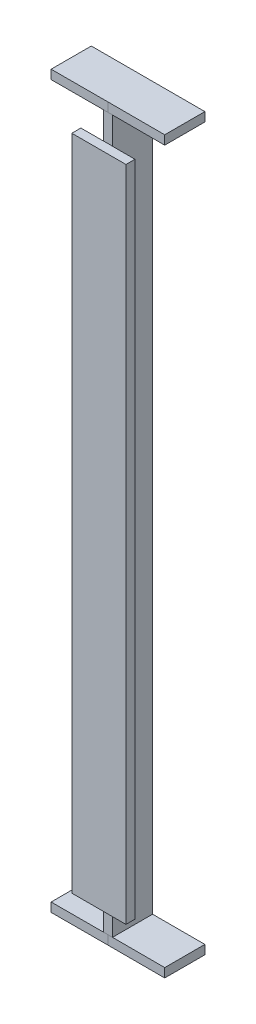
ISO-10303-21;
HEADER;
FILE_DESCRIPTION(('STEP AP214'),'2;1');
FILE_NAME('part.step','',(''),(''),'','','');
FILE_SCHEMA(('AUTOMOTIVE_DESIGN { 1 0 10303 214 1 1 1 1 }'));
ENDSEC;
DATA;
#1=APPLICATION_CONTEXT('core data for automotive mechanical design processes');
#2=APPLICATION_PROTOCOL_DEFINITION('international standard','automotive_design',2000,#1);
#3=PRODUCT_CONTEXT('',#1,'mechanical');
#4=PRODUCT('Part','Part','',(#3));
#5=PRODUCT_RELATED_PRODUCT_CATEGORY('part','',(#4));
#6=PRODUCT_DEFINITION_FORMATION('','',#4);
#7=PRODUCT_DEFINITION_CONTEXT('part definition',#1,'design');
#8=PRODUCT_DEFINITION('design','',#6,#7);
#9=PRODUCT_DEFINITION_SHAPE('','',#8);
#10=(LENGTH_UNIT() NAMED_UNIT(*) SI_UNIT(.MILLI.,.METRE.));
#11=(NAMED_UNIT(*) PLANE_ANGLE_UNIT() SI_UNIT($,.RADIAN.));
#12=(NAMED_UNIT(*) SI_UNIT($,.STERADIAN.) SOLID_ANGLE_UNIT());
#13=UNCERTAINTY_MEASURE_WITH_UNIT(LENGTH_MEASURE(1.E-05),#10,'distance_accuracy_value','');
#14=(GEOMETRIC_REPRESENTATION_CONTEXT(3) GLOBAL_UNCERTAINTY_ASSIGNED_CONTEXT((#13)) GLOBAL_UNIT_ASSIGNED_CONTEXT((#10,
#11,#12)) REPRESENTATION_CONTEXT('',''));
#15=CARTESIAN_POINT('',(0.,0.,0.));
#16=DIRECTION('',(0.,0.,1.));
#17=DIRECTION('',(1.,0.,0.));
#18=AXIS2_PLACEMENT_3D('',#15,#16,#17);
#19=CARTESIAN_POINT('',(0.,-19.999993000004,0.));
#20=DIRECTION('',(0.,-1.,0.));
#21=DIRECTION('',(0.,0.,-1.));
#22=AXIS2_PLACEMENT_3D('',#19,#20,#21);
#23=PLANE('',#22);
#24=DIRECTION('',(-1.,0.,0.));
#25=VECTOR('',#24,1.);
#26=CARTESIAN_POINT('',(1425.0409965,-19.999993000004,1746.042967));
#27=LINE('',#26,#25);
#28=CARTESIAN_POINT('',(1357.041001,-19.999993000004,1746.042967));
#29=VERTEX_POINT('',#28);
#30=CARTESIAN_POINT('',(1299.0409965,-19.999993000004,1746.042967));
#31=VERTEX_POINT('',#30);
#32=EDGE_CURVE('E125',#29,#31,#27,.T.);
#33=ORIENTED_EDGE('',*,*,#32,.F.);
#34=DIRECTION('',(0.,0.,1.));
#35=VECTOR('',#34,1.);
#36=CARTESIAN_POINT('',(1357.041001,-19.999993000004,0.));
#37=LINE('',#36,#35);
#38=CARTESIAN_POINT('',(1357.04100406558,-19.999993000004,1790.52054497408));
#39=VERTEX_POINT('',#38);
#40=EDGE_CURVE('E131',#29,#39,#37,.T.);
#41=ORIENTED_EDGE('',*,*,#40,.T.);
#42=DIRECTION('',(0.999999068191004,0.,-0.00136514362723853));
#43=VECTOR('',#42,1.);
#44=CARTESIAN_POINT('',(1299.0409965,-19.999993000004,1790.601969));
#45=LINE('',#44,#43);
#46=CARTESIAN_POINT('',(1299.0409965,-19.999993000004,1790.601969));
#47=VERTEX_POINT('',#46);
#48=EDGE_CURVE('E193',#47,#39,#45,.T.);
#49=ORIENTED_EDGE('',*,*,#48,.F.);
#50=DIRECTION('',(0.,0.,1.));
#51=VECTOR('',#50,1.);
#52=CARTESIAN_POINT('',(1299.0409965,-19.999993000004,1746.042967));
#53=LINE('',#52,#51);
#54=EDGE_CURVE('E119',#31,#47,#53,.T.);
#55=ORIENTED_EDGE('',*,*,#54,.F.);
#56=EDGE_LOOP('',(#33,#41,#49,#55));
#57=FACE_BOUND('',#56,.T.);
#58=ADVANCED_FACE('F39',(#57),#23,.T.);
#59=DIRECTION('',(0.999999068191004,0.,0.00136514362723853));
#60=VECTOR('',#59,1.);
#61=CARTESIAN_POINT('',(1425.0409965,-19.999993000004,1790.601969));
#62=LINE('',#61,#60);
#63=CARTESIAN_POINT('',(1367.04097653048,-19.999993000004,1790.51846885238));
#64=VERTEX_POINT('',#63);
#65=CARTESIAN_POINT('',(1425.0409965,-19.999993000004,1790.601969));
#66=VERTEX_POINT('',#65);
#67=EDGE_CURVE('E137',#64,#66,#62,.T.);
#68=ORIENTED_EDGE('',*,*,#67,.F.);
#69=DIRECTION('',(0.,0.,-1.));
#70=VECTOR('',#69,1.);
#71=CARTESIAN_POINT('',(1367.040992,-19.999993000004,0.));
#72=LINE('',#71,#70);
#73=CARTESIAN_POINT('',(1367.040992,-19.999993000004,1746.042967));
#74=VERTEX_POINT('',#73);
#75=EDGE_CURVE('E128',#64,#74,#72,.T.);
#76=ORIENTED_EDGE('',*,*,#75,.T.);
#77=CARTESIAN_POINT('',(1425.0409965,-19.999993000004,1746.042967));
#78=VERTEX_POINT('',#77);
#79=EDGE_CURVE('E142',#78,#74,#27,.T.);
#80=ORIENTED_EDGE('',*,*,#79,.F.);
#81=DIRECTION('',(0.,0.,-1.));
#82=VECTOR('',#81,1.);
#83=CARTESIAN_POINT('',(1425.0409965,-19.999993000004,1746.042967));
#84=LINE('',#83,#82);
#85=EDGE_CURVE('E199',#66,#78,#84,.T.);
#86=ORIENTED_EDGE('',*,*,#85,.F.);
#87=EDGE_LOOP('',(#68,#76,#80,#86));
#88=FACE_BOUND('',#87,.T.);
#89=ADVANCED_FACE('F208',(#88),#23,.T.);
#90=CARTESIAN_POINT('',(1299.0409965,-19.999993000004,1746.042967));
#91=DIRECTION('',(-1.,0.,0.));
#92=DIRECTION('',(0.,0.,1.));
#93=AXIS2_PLACEMENT_3D('',#90,#91,#92);
#94=PLANE('',#93);
#95=DIRECTION('',(0.,0.,1.));
#96=VECTOR('',#95,1.);
#97=CARTESIAN_POINT('',(1299.0409965,-9.99999300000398,1746.042967));
#98=LINE('',#97,#96);
#99=CARTESIAN_POINT('',(1299.0409965,-9.99999300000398,1746.042967));
#100=VERTEX_POINT('',#99);
#101=CARTESIAN_POINT('',(1299.0409965,-9.99999300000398,1790.601969));
#102=VERTEX_POINT('',#101);
#103=EDGE_CURVE('E116',#100,#102,#98,.T.);
#104=ORIENTED_EDGE('',*,*,#103,.F.);
#105=DIRECTION('',(0.,1.,0.));
#106=VECTOR('',#105,1.);
#107=CARTESIAN_POINT('',(1299.0409965,-19.999993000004,1746.042967));
#108=LINE('',#107,#106);
#109=EDGE_CURVE('E12',#31,#100,#108,.T.);
#110=ORIENTED_EDGE('',*,*,#109,.F.);
#111=ORIENTED_EDGE('',*,*,#54,.T.);
#112=DIRECTION('',(0.,1.,0.));
#113=VECTOR('',#112,1.);
#114=CARTESIAN_POINT('',(1299.0409965,-19.999993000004,1790.601969));
#115=LINE('',#114,#113);
#116=EDGE_CURVE('E79',#47,#102,#115,.T.);
#117=ORIENTED_EDGE('',*,*,#116,.T.);
#118=EDGE_LOOP('',(#104,#110,#111,#117));
#119=FACE_BOUND('',#118,.T.);
#120=ADVANCED_FACE('F41',(#119),#94,.T.);
#121=CARTESIAN_POINT('',(1425.0409965,-19.999993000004,1746.042967));
#122=DIRECTION('',(0.,0.,-1.));
#123=DIRECTION('',(-1.,0.,0.));
#124=AXIS2_PLACEMENT_3D('',#121,#122,#123);
#125=PLANE('',#124);
#126=ORIENTED_EDGE('',*,*,#109,.T.);
#127=DIRECTION('',(-1.,0.,0.));
#128=VECTOR('',#127,1.);
#129=CARTESIAN_POINT('',(1425.0409965,-9.99999300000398,1746.042967));
#130=LINE('',#129,#128);
#131=CARTESIAN_POINT('',(1425.0409965,-9.99999300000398,1746.042967));
#132=VERTEX_POINT('',#131);
#133=EDGE_CURVE('E113',#132,#100,#130,.T.);
#134=ORIENTED_EDGE('',*,*,#133,.F.);
#135=DIRECTION('',(0.,1.,0.));
#136=VECTOR('',#135,1.);
#137=CARTESIAN_POINT('',(1425.0409965,-19.999993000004,1746.042967));
#138=LINE('',#137,#136);
#139=EDGE_CURVE('E49',#78,#132,#138,.T.);
#140=ORIENTED_EDGE('',*,*,#139,.F.);
#141=ORIENTED_EDGE('',*,*,#79,.T.);
#142=DIRECTION('',(0.,1.,0.));
#143=VECTOR('',#142,1.);
#144=CARTESIAN_POINT('',(1367.040992,-819.999993,1746.042967));
#145=LINE('',#144,#143);
#146=CARTESIAN_POINT('',(1367.040992,-809.999999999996,1746.042967));
#147=VERTEX_POINT('',#146);
#148=EDGE_CURVE('E88',#147,#74,#145,.T.);
#149=ORIENTED_EDGE('',*,*,#148,.F.);
#150=DIRECTION('',(-1.,0.,0.));
#151=VECTOR('',#150,1.);
#152=CARTESIAN_POINT('',(1425.0409965,-809.999999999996,1746.042967));
#153=LINE('',#152,#151);
#154=CARTESIAN_POINT('',(1425.0409965,-809.999999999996,1746.042967));
#155=VERTEX_POINT('',#154);
#156=EDGE_CURVE('E215',#155,#147,#153,.T.);
#157=ORIENTED_EDGE('',*,*,#156,.F.);
#158=DIRECTION('',(0.,-1.,0.));
#159=VECTOR('',#158,1.);
#160=CARTESIAN_POINT('',(1425.0409965,-809.999999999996,1746.042967));
#161=LINE('',#160,#159);
#162=CARTESIAN_POINT('',(1425.0409965,-819.999999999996,1746.042967));
#163=VERTEX_POINT('',#162);
#164=EDGE_CURVE('E438',#155,#163,#161,.T.);
#165=ORIENTED_EDGE('',*,*,#164,.T.);
#166=DIRECTION('',(-1.,0.,0.));
#167=VECTOR('',#166,1.);
#168=CARTESIAN_POINT('',(1425.0409965,-819.999999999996,1746.042967));
#169=LINE('',#168,#167);
#170=CARTESIAN_POINT('',(1299.0409965,-819.999999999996,1746.042967));
#171=VERTEX_POINT('',#170);
#172=EDGE_CURVE('E248',#163,#171,#169,.T.);
#173=ORIENTED_EDGE('',*,*,#172,.T.);
#174=DIRECTION('',(0.,-1.,0.));
#175=VECTOR('',#174,1.);
#176=CARTESIAN_POINT('',(1299.0409965,-809.999999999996,1746.042967));
#177=LINE('',#176,#175);
#178=CARTESIAN_POINT('',(1299.0409965,-809.999999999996,1746.042967));
#179=VERTEX_POINT('',#178);
#180=EDGE_CURVE('E245',#179,#171,#177,.T.);
#181=ORIENTED_EDGE('',*,*,#180,.F.);
#182=CARTESIAN_POINT('',(1357.041001,-809.999999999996,1746.042967));
#183=VERTEX_POINT('',#182);
#184=EDGE_CURVE('E234',#183,#179,#153,.T.);
#185=ORIENTED_EDGE('',*,*,#184,.F.);
#186=DIRECTION('',(0.,1.,0.));
#187=VECTOR('',#186,1.);
#188=CARTESIAN_POINT('',(1357.041001,-819.999993,1746.042967));
#189=LINE('',#188,#187);
#190=EDGE_CURVE('E219',#183,#29,#189,.T.);
#191=ORIENTED_EDGE('',*,*,#190,.T.);
#192=ORIENTED_EDGE('',*,*,#32,.T.);
#193=EDGE_LOOP('',(#126,#134,#140,#141,#149,#157,#165,#173,#181,#185,#191,#192));
#194=FACE_BOUND('',#193,.T.);
#195=ADVANCED_FACE('F122',(#194),#125,.T.);
#196=CARTESIAN_POINT('',(1425.0409965,-19.999993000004,1746.042967));
#197=DIRECTION('',(1.,0.,0.));
#198=DIRECTION('',(0.,0.,-1.));
#199=AXIS2_PLACEMENT_3D('',#196,#197,#198);
#200=PLANE('',#199);
#201=DIRECTION('',(0.,0.,-1.));
#202=VECTOR('',#201,1.);
#203=CARTESIAN_POINT('',(1425.0409965,-9.99999300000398,1746.042967));
#204=LINE('',#203,#202);
#205=CARTESIAN_POINT('',(1425.0409965,-9.99999300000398,1790.601969));
#206=VERTEX_POINT('',#205);
#207=EDGE_CURVE('E117',#206,#132,#204,.T.);
#208=ORIENTED_EDGE('',*,*,#207,.F.);
#209=DIRECTION('',(0.,1.,0.));
#210=VECTOR('',#209,1.);
#211=CARTESIAN_POINT('',(1425.0409965,-19.999993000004,1790.601969));
#212=LINE('',#211,#210);
#213=EDGE_CURVE('E146',#66,#206,#212,.T.);
#214=ORIENTED_EDGE('',*,*,#213,.F.);
#215=ORIENTED_EDGE('',*,*,#85,.T.);
#216=ORIENTED_EDGE('',*,*,#139,.T.);
#217=EDGE_LOOP('',(#208,#214,#215,#216));
#218=FACE_BOUND('',#217,.T.);
#219=ADVANCED_FACE('F175',(#218),#200,.T.);
#220=CARTESIAN_POINT('',(1425.0409965,-19.999993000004,1790.601969));
#221=DIRECTION('',(-0.00136514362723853,0.,0.999999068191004));
#222=DIRECTION('',(0.999999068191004,0.,0.00136514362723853));
#223=AXIS2_PLACEMENT_3D('',#220,#221,#222);
#224=PLANE('',#223);
#225=CARTESIAN_POINT('',(1362.0409965,-19.999993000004,1790.51596487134));
#226=DIRECTION('',(0.999999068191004,0.,0.00136514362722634));
#227=VECTOR('',#226,1.);
#228=LINE('',#225,#227);
#229=CARTESIAN_POINT('',(1362.0409965,-19.999993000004,1790.51596487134));
#230=VERTEX_POINT('',#229);
#231=EDGE_CURVE('E200',#230,#64,#228,.T.);
#232=ORIENTED_EDGE('',*,*,#231,.T.);
#233=ORIENTED_EDGE('',*,*,#67,.T.);
#234=ORIENTED_EDGE('',*,*,#213,.T.);
#235=DIRECTION('',(0.999999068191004,0.,0.00136514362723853));
#236=VECTOR('',#235,1.);
#237=CARTESIAN_POINT('',(1362.0409965,-9.99999300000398,1790.51596487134));
#238=LINE('',#237,#236);
#239=CARTESIAN_POINT('',(1367.0409857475,-9.99999300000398,1790.52279058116));
#240=VERTEX_POINT('',#239);
#241=EDGE_CURVE('E155',#240,#206,#238,.T.);
#242=ORIENTED_EDGE('',*,*,#241,.F.);
#243=DIRECTION('',(0.999999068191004,0.,0.00136514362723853));
#244=VECTOR('',#243,1.);
#245=CARTESIAN_POINT('',(1362.0409965,-9.99999300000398,1790.51596487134));
#246=LINE('',#245,#244);
#247=CARTESIAN_POINT('',(1362.04099650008,-9.99999300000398,1790.51596487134));
#248=VERTEX_POINT('',#247);
#249=EDGE_CURVE('E153',#248,#240,#246,.T.);
#250=ORIENTED_EDGE('',*,*,#249,.F.);
#251=DIRECTION('',(0.,1.,0.));
#252=VECTOR('',#251,1.);
#253=CARTESIAN_POINT('',(1362.0409965,-19.999993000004,1790.51596487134));
#254=LINE('',#253,#252);
#255=EDGE_CURVE('E147',#230,#248,#254,.T.);
#256=ORIENTED_EDGE('',*,*,#255,.F.);
#257=EDGE_LOOP('',(#232,#233,#234,#242,#250,#256));
#258=FACE_BOUND('',#257,.T.);
#259=ADVANCED_FACE('F165',(#258),#224,.T.);
#260=CARTESIAN_POINT('',(1299.0409965,-19.999993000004,1790.601969));
#261=DIRECTION('',(0.00136514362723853,0.,0.999999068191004));
#262=DIRECTION('',(0.999999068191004,0.,-0.00136514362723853));
#263=AXIS2_PLACEMENT_3D('',#260,#261,#262);
#264=PLANE('',#263);
#265=DIRECTION('',(0.999999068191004,0.,-0.00136514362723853));
#266=VECTOR('',#265,1.);
#267=CARTESIAN_POINT('',(1299.0409965,-9.99999300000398,1790.601969));
#268=LINE('',#267,#266);
#269=CARTESIAN_POINT('',(1357.04100713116,-9.99999300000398,1790.52279058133));
#270=VERTEX_POINT('',#269);
#271=EDGE_CURVE('E127',#270,#248,#268,.T.);
#272=ORIENTED_EDGE('',*,*,#271,.F.);
#273=DIRECTION('',(0.999999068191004,0.,-0.00136514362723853));
#274=VECTOR('',#273,1.);
#275=CARTESIAN_POINT('',(1299.0409965,-9.99999300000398,1790.601969));
#276=LINE('',#275,#274);
#277=EDGE_CURVE('E43',#102,#270,#276,.T.);
#278=ORIENTED_EDGE('',*,*,#277,.F.);
#279=ORIENTED_EDGE('',*,*,#116,.F.);
#280=ORIENTED_EDGE('',*,*,#48,.T.);
#281=CARTESIAN_POINT('',(1357.04100713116,-19.999993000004,1790.52279058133));
#282=DIRECTION('',(0.999999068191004,0.,-0.00136514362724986));
#283=VECTOR('',#282,1.);
#284=LINE('',#281,#283);
#285=EDGE_CURVE('E191',#39,#230,#284,.T.);
#286=ORIENTED_EDGE('',*,*,#285,.T.);
#287=ORIENTED_EDGE('',*,*,#255,.T.);
#288=EDGE_LOOP('',(#272,#278,#279,#280,#286,#287));
#289=FACE_BOUND('',#288,.T.);
#290=ADVANCED_FACE('F174',(#289),#264,.T.);
#291=CARTESIAN_POINT('',(0.,-9.99999300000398,0.));
#292=DIRECTION('',(0.,-1.,0.));
#293=DIRECTION('',(0.,0.,-1.));
#294=AXIS2_PLACEMENT_3D('',#291,#292,#293);
#295=PLANE('',#294);
#296=ORIENTED_EDGE('',*,*,#133,.T.);
#297=ORIENTED_EDGE('',*,*,#103,.T.);
#298=ORIENTED_EDGE('',*,*,#277,.T.);
#299=ORIENTED_EDGE('',*,*,#271,.T.);
#300=ORIENTED_EDGE('',*,*,#249,.T.);
#301=ORIENTED_EDGE('',*,*,#241,.T.);
#302=ORIENTED_EDGE('',*,*,#207,.T.);
#303=EDGE_LOOP('',(#296,#297,#298,#299,#300,#301,#302));
#304=FACE_BOUND('',#303,.T.);
#305=ADVANCED_FACE('F114',(#304),#295,.F.);
#306=CARTESIAN_POINT('',(0.836287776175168,0.,1791.15151069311));
#307=DIRECTION('',(-0.000466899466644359,0.,-0.999999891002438));
#308=DIRECTION('',(-0.999999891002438,0.,0.000466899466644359));
#309=AXIS2_PLACEMENT_3D('',#306,#307,#308);
#310=PLANE('',#309);
#311=ORIENTED_EDGE('',*,*,#285,.F.);
#312=DIRECTION('',(0.,1.,0.));
#313=VECTOR('',#312,1.);
#314=CARTESIAN_POINT('',(1357.041001,-819.999993,1790.51829936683));
#315=LINE('',#314,#313);
#316=CARTESIAN_POINT('',(1357.041001,-50.0045624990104,1790.51829936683));
#317=VERTEX_POINT('',#316);
#318=EDGE_CURVE('E58',#317,#39,#315,.T.);
#319=ORIENTED_EDGE('',*,*,#318,.F.);
#320=DIRECTION('',(0.999999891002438,0.,-0.000466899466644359));
#321=VECTOR('',#320,1.);
#322=CARTESIAN_POINT('',(1419.64539746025,-50.0045624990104,1790.48906940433));
#323=LINE('',#322,#321);
#324=CARTESIAN_POINT('',(1367.040992,-50.0045624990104,1790.51363037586));
#325=VERTEX_POINT('',#324);
#326=EDGE_CURVE('E342',#317,#325,#323,.T.);
#327=ORIENTED_EDGE('',*,*,#326,.T.);
#328=DIRECTION('',(0.,-1.,0.));
#329=VECTOR('',#328,1.);
#330=CARTESIAN_POINT('',(1367.040992,-819.999993,1790.51363037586));
#331=LINE('',#330,#329);
#332=EDGE_CURVE('E296',#64,#325,#331,.T.);
#333=ORIENTED_EDGE('',*,*,#332,.F.);
#334=ORIENTED_EDGE('',*,*,#231,.F.);
#335=EDGE_LOOP('',(#311,#319,#327,#333,#334));
#336=FACE_BOUND('',#335,.T.);
#337=ADVANCED_FACE('F357',(#336),#310,.F.);
#338=CARTESIAN_POINT('',(0.,-809.999999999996,0.));
#339=DIRECTION('',(0.,1.,0.));
#340=DIRECTION('',(0.,0.,-1.));
#341=AXIS2_PLACEMENT_3D('',#338,#339,#340);
#342=PLANE('',#341);
#343=DIRECTION('',(0.999999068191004,0.,-0.00136514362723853));
#344=VECTOR('',#343,1.);
#345=CARTESIAN_POINT('',(1299.0409965,-809.999999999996,1790.601969));
#346=LINE('',#345,#344);
#347=CARTESIAN_POINT('',(1299.0409965,-809.999999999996,1790.601969));
#348=VERTEX_POINT('',#347);
#349=CARTESIAN_POINT('',(1357.04100406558,-809.999999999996,1790.52054497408));
#350=VERTEX_POINT('',#349);
#351=EDGE_CURVE('E255',#348,#350,#346,.T.);
#352=ORIENTED_EDGE('',*,*,#351,.T.);
#353=DIRECTION('',(0.,0.,-1.));
#354=VECTOR('',#353,1.);
#355=CARTESIAN_POINT('',(1357.041001,-809.999999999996,0.));
#356=LINE('',#355,#354);
#357=EDGE_CURVE('E269',#350,#183,#356,.T.);
#358=ORIENTED_EDGE('',*,*,#357,.T.);
#359=ORIENTED_EDGE('',*,*,#184,.T.);
#360=DIRECTION('',(0.,0.,1.));
#361=VECTOR('',#360,1.);
#362=CARTESIAN_POINT('',(1299.0409965,-809.999999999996,1746.042967));
#363=LINE('',#362,#361);
#364=EDGE_CURVE('E252',#179,#348,#363,.T.);
#365=ORIENTED_EDGE('',*,*,#364,.T.);
#366=EDGE_LOOP('',(#352,#358,#359,#365));
#367=FACE_BOUND('',#366,.T.);
#368=ADVANCED_FACE('F421',(#367),#342,.T.);
#369=ORIENTED_EDGE('',*,*,#156,.T.);
#370=DIRECTION('',(0.,0.,1.));
#371=VECTOR('',#370,1.);
#372=CARTESIAN_POINT('',(1367.040992,-809.999999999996,0.));
#373=LINE('',#372,#371);
#374=CARTESIAN_POINT('',(1367.04096895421,-809.999999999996,1790.51821885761));
#375=VERTEX_POINT('',#374);
#376=EDGE_CURVE('E228',#147,#375,#373,.T.);
#377=ORIENTED_EDGE('',*,*,#376,.T.);
#378=DIRECTION('',(0.999999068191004,0.,0.00136514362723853));
#379=VECTOR('',#378,1.);
#380=CARTESIAN_POINT('',(1425.0409965,-809.999999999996,1790.601969));
#381=LINE('',#380,#379);
#382=CARTESIAN_POINT('',(1425.0409965,-809.999999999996,1790.601969));
#383=VERTEX_POINT('',#382);
#384=EDGE_CURVE('E259',#375,#383,#381,.T.);
#385=ORIENTED_EDGE('',*,*,#384,.T.);
#386=DIRECTION('',(0.,0.,-1.));
#387=VECTOR('',#386,1.);
#388=CARTESIAN_POINT('',(1425.0409965,-809.999999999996,1746.042967));
#389=LINE('',#388,#387);
#390=EDGE_CURVE('E231',#383,#155,#389,.T.);
#391=ORIENTED_EDGE('',*,*,#390,.T.);
#392=EDGE_LOOP('',(#369,#377,#385,#391));
#393=FACE_BOUND('',#392,.T.);
#394=ADVANCED_FACE('F225',(#393),#342,.T.);
#395=CARTESIAN_POINT('',(1299.0409965,-809.999999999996,1746.042967));
#396=DIRECTION('',(-1.,0.,0.));
#397=DIRECTION('',(0.,0.,1.));
#398=AXIS2_PLACEMENT_3D('',#395,#396,#397);
#399=PLANE('',#398);
#400=DIRECTION('',(0.,0.,1.));
#401=VECTOR('',#400,1.);
#402=CARTESIAN_POINT('',(1299.0409965,-819.999999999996,1746.042967));
#403=LINE('',#402,#401);
#404=CARTESIAN_POINT('',(1299.0409965,-819.999999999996,1790.601969));
#405=VERTEX_POINT('',#404);
#406=EDGE_CURVE('E268',#171,#405,#403,.T.);
#407=ORIENTED_EDGE('',*,*,#406,.T.);
#408=DIRECTION('',(0.,-1.,0.));
#409=VECTOR('',#408,1.);
#410=CARTESIAN_POINT('',(1299.0409965,-809.999999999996,1790.601969));
#411=LINE('',#410,#409);
#412=EDGE_CURVE('E233',#348,#405,#411,.T.);
#413=ORIENTED_EDGE('',*,*,#412,.F.);
#414=ORIENTED_EDGE('',*,*,#364,.F.);
#415=ORIENTED_EDGE('',*,*,#180,.T.);
#416=EDGE_LOOP('',(#407,#413,#414,#415));
#417=FACE_BOUND('',#416,.T.);
#418=ADVANCED_FACE('F505',(#417),#399,.T.);
#419=CARTESIAN_POINT('',(1425.0409965,-809.999999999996,1746.042967));
#420=DIRECTION('',(1.,0.,0.));
#421=DIRECTION('',(0.,0.,-1.));
#422=AXIS2_PLACEMENT_3D('',#419,#420,#421);
#423=PLANE('',#422);
#424=DIRECTION('',(0.,0.,-1.));
#425=VECTOR('',#424,1.);
#426=CARTESIAN_POINT('',(1425.0409965,-819.999999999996,1746.042967));
#427=LINE('',#426,#425);
#428=CARTESIAN_POINT('',(1425.0409965,-819.999999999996,1790.601969));
#429=VERTEX_POINT('',#428);
#430=EDGE_CURVE('E253',#429,#163,#427,.T.);
#431=ORIENTED_EDGE('',*,*,#430,.T.);
#432=ORIENTED_EDGE('',*,*,#164,.F.);
#433=ORIENTED_EDGE('',*,*,#390,.F.);
#434=DIRECTION('',(0.,-1.,0.));
#435=VECTOR('',#434,1.);
#436=CARTESIAN_POINT('',(1425.0409965,-809.999999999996,1790.601969));
#437=LINE('',#436,#435);
#438=EDGE_CURVE('E445',#383,#429,#437,.T.);
#439=ORIENTED_EDGE('',*,*,#438,.T.);
#440=EDGE_LOOP('',(#431,#432,#433,#439));
#441=FACE_BOUND('',#440,.T.);
#442=ADVANCED_FACE('F495',(#441),#423,.T.);
#443=CARTESIAN_POINT('',(1425.0409965,-809.999999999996,1790.601969));
#444=DIRECTION('',(-0.00136514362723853,0.,0.999999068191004));
#445=DIRECTION('',(0.999999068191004,0.,0.00136514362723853));
#446=AXIS2_PLACEMENT_3D('',#443,#444,#445);
#447=PLANE('',#446);
#448=ORIENTED_EDGE('',*,*,#384,.F.);
#449=CARTESIAN_POINT('',(1362.0409965,-809.999999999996,1790.51596487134));
#450=DIRECTION('',(0.999999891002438,0.,-0.000466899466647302));
#451=VECTOR('',#450,1.);
#452=LINE('',#449,#451);
#453=CARTESIAN_POINT('',(1362.0409965,-809.999999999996,1790.51596487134));
#454=VERTEX_POINT('',#453);
#455=EDGE_CURVE('E464',#454,#375,#452,.T.);
#456=ORIENTED_EDGE('',*,*,#455,.F.);
#457=DIRECTION('',(0.,-1.,0.));
#458=VECTOR('',#457,1.);
#459=CARTESIAN_POINT('',(1362.0409965,-809.999999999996,1790.51596487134));
#460=LINE('',#459,#458);
#461=CARTESIAN_POINT('',(1362.04099649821,-819.999999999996,1790.51596487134));
#462=VERTEX_POINT('',#461);
#463=EDGE_CURVE('E237',#454,#462,#460,.T.);
#464=ORIENTED_EDGE('',*,*,#463,.T.);
#465=DIRECTION('',(0.999999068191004,0.,0.00136514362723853));
#466=VECTOR('',#465,1.);
#467=CARTESIAN_POINT('',(1425.0409965,-819.999999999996,1790.601969));
#468=LINE('',#467,#466);
#469=CARTESIAN_POINT('',(1367.0409857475,-819.999999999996,1790.52279058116));
#470=VERTEX_POINT('',#469);
#471=EDGE_CURVE('E463',#462,#470,#468,.T.);
#472=ORIENTED_EDGE('',*,*,#471,.T.);
#473=DIRECTION('',(0.999999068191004,0.,0.00136514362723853));
#474=VECTOR('',#473,1.);
#475=CARTESIAN_POINT('',(1425.0409965,-819.999999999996,1790.601969));
#476=LINE('',#475,#474);
#477=EDGE_CURVE('E478',#470,#429,#476,.T.);
#478=ORIENTED_EDGE('',*,*,#477,.T.);
#479=ORIENTED_EDGE('',*,*,#438,.F.);
#480=EDGE_LOOP('',(#448,#456,#464,#472,#478,#479));
#481=FACE_BOUND('',#480,.T.);
#482=ADVANCED_FACE('F460',(#481),#447,.T.);
#483=CARTESIAN_POINT('',(1299.0409965,-809.999999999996,1790.601969));
#484=DIRECTION('',(0.00136514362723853,0.,0.999999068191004));
#485=DIRECTION('',(0.999999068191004,0.,-0.00136514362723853));
#486=AXIS2_PLACEMENT_3D('',#483,#484,#485);
#487=PLANE('',#486);
#488=DIRECTION('',(0.999999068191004,0.,-0.00136514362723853));
#489=VECTOR('',#488,1.);
#490=CARTESIAN_POINT('',(1299.0409965,-819.999999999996,1790.601969));
#491=LINE('',#490,#489);
#492=CARTESIAN_POINT('',(1357.04100713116,-819.999999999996,1790.52279058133));
#493=VERTEX_POINT('',#492);
#494=EDGE_CURVE('E481',#405,#493,#491,.T.);
#495=ORIENTED_EDGE('',*,*,#494,.T.);
#496=DIRECTION('',(0.999999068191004,0.,-0.00136514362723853));
#497=VECTOR('',#496,1.);
#498=CARTESIAN_POINT('',(1299.0409965,-819.999999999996,1790.601969));
#499=LINE('',#498,#497);
#500=EDGE_CURVE('E451',#493,#462,#499,.T.);
#501=ORIENTED_EDGE('',*,*,#500,.T.);
#502=ORIENTED_EDGE('',*,*,#463,.F.);
#503=CARTESIAN_POINT('',(1357.04100503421,-809.999999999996,1790.51829936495));
#504=DIRECTION('',(0.999999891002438,0.,-0.000466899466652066));
#505=VECTOR('',#504,1.);
#506=LINE('',#503,#505);
#507=EDGE_CURVE('E388',#350,#454,#506,.T.);
#508=ORIENTED_EDGE('',*,*,#507,.F.);
#509=ORIENTED_EDGE('',*,*,#351,.F.);
#510=ORIENTED_EDGE('',*,*,#412,.T.);
#511=EDGE_LOOP('',(#495,#501,#502,#508,#509,#510));
#512=FACE_BOUND('',#511,.T.);
#513=ADVANCED_FACE('F485',(#512),#487,.T.);
#514=CARTESIAN_POINT('',(0.,-819.999999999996,0.));
#515=DIRECTION('',(0.,1.,0.));
#516=DIRECTION('',(0.,0.,-1.));
#517=AXIS2_PLACEMENT_3D('',#514,#515,#516);
#518=PLANE('',#517);
#519=ORIENTED_EDGE('',*,*,#406,.F.);
#520=ORIENTED_EDGE('',*,*,#172,.F.);
#521=ORIENTED_EDGE('',*,*,#430,.F.);
#522=ORIENTED_EDGE('',*,*,#477,.F.);
#523=ORIENTED_EDGE('',*,*,#471,.F.);
#524=ORIENTED_EDGE('',*,*,#500,.F.);
#525=ORIENTED_EDGE('',*,*,#494,.F.);
#526=EDGE_LOOP('',(#519,#520,#521,#522,#523,#524,#525));
#527=FACE_BOUND('',#526,.T.);
#528=ADVANCED_FACE('F473',(#527),#518,.F.);
#529=CARTESIAN_POINT('',(1332.040906,-819.999993,1800.629973));
#530=DIRECTION('',(-0.000466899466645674,0.,-0.999999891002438));
#531=DIRECTION('',(-0.999999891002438,0.,0.000466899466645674));
#532=AXIS2_PLACEMENT_3D('',#529,#530,#531);
#533=PLANE('',#532);
#534=DIRECTION('',(0.,1.,0.));
#535=VECTOR('',#534,1.);
#536=CARTESIAN_POINT('',(1392.040968,-819.999993,1800.601959));
#537=LINE('',#536,#535);
#538=CARTESIAN_POINT('',(1392.040968,-779.999993,1800.601959));
#539=VERTEX_POINT('',#538);
#540=CARTESIAN_POINT('',(1392.040968,-50.0045624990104,1800.601959));
#541=VERTEX_POINT('',#540);
#542=EDGE_CURVE('E293',#539,#541,#537,.T.);
#543=ORIENTED_EDGE('',*,*,#542,.T.);
#544=DIRECTION('',(0.999999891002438,0.,-0.000466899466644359));
#545=VECTOR('',#544,1.);
#546=CARTESIAN_POINT('',(1419.65011314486,-50.0045624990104,1800.58906830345));
#547=LINE('',#546,#545);
#548=CARTESIAN_POINT('',(1332.040906,-50.0045624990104,1800.629973));
#549=VERTEX_POINT('',#548);
#550=EDGE_CURVE('E349',#549,#541,#547,.T.);
#551=ORIENTED_EDGE('',*,*,#550,.F.);
#552=DIRECTION('',(0.,1.,0.));
#553=VECTOR('',#552,1.);
#554=CARTESIAN_POINT('',(1332.040906,-819.999993,1800.629973));
#555=LINE('',#554,#553);
#556=CARTESIAN_POINT('',(1332.040906,-779.999993,1800.629973));
#557=VERTEX_POINT('',#556);
#558=EDGE_CURVE('E292',#557,#549,#555,.T.);
#559=ORIENTED_EDGE('',*,*,#558,.F.);
#560=DIRECTION('',(-0.999999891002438,0.,0.000466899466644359));
#561=VECTOR('',#560,1.);
#562=CARTESIAN_POINT('',(1419.65011314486,-779.999993,1800.58906830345));
#563=LINE('',#562,#561);
#564=EDGE_CURVE('E343',#539,#557,#563,.T.);
#565=ORIENTED_EDGE('',*,*,#564,.F.);
#566=EDGE_LOOP('',(#543,#551,#559,#565));
#567=FACE_BOUND('',#566,.T.);
#568=ADVANCED_FACE('F492',(#567),#533,.F.);
#569=CARTESIAN_POINT('',(1392.040968,-819.999993,1800.601959));
#570=DIRECTION('',(-1.,0.,0.));
#571=DIRECTION('',(0.,0.,1.));
#572=AXIS2_PLACEMENT_3D('',#569,#570,#571);
#573=PLANE('',#572);
#574=DIRECTION('',(0.,1.,0.));
#575=VECTOR('',#574,1.);
#576=CARTESIAN_POINT('',(1392.040968,-819.999993,1790.601969));
#577=LINE('',#576,#575);
#578=CARTESIAN_POINT('',(1392.040968,-779.999993,1790.601969));
#579=VERTEX_POINT('',#578);
#580=CARTESIAN_POINT('',(1392.040968,-50.0045624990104,1790.601969));
#581=VERTEX_POINT('',#580);
#582=EDGE_CURVE('E287',#579,#581,#577,.T.);
#583=ORIENTED_EDGE('',*,*,#582,.T.);
#584=DIRECTION('',(0.,0.,1.));
#585=VECTOR('',#584,1.);
#586=CARTESIAN_POINT('',(1392.040968,-50.0045624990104,1800.601959));
#587=LINE('',#586,#585);
#588=EDGE_CURVE('E312',#581,#541,#587,.T.);
#589=ORIENTED_EDGE('',*,*,#588,.T.);
#590=ORIENTED_EDGE('',*,*,#542,.F.);
#591=DIRECTION('',(0.,0.,-1.));
#592=VECTOR('',#591,1.);
#593=CARTESIAN_POINT('',(1392.040968,-779.999993,1800.601959));
#594=LINE('',#593,#592);
#595=EDGE_CURVE('E327',#539,#579,#594,.T.);
#596=ORIENTED_EDGE('',*,*,#595,.T.);
#597=EDGE_LOOP('',(#583,#589,#590,#596));
#598=FACE_BOUND('',#597,.T.);
#599=ADVANCED_FACE('F589',(#598),#573,.F.);
#600=CARTESIAN_POINT('',(1392.040968,-819.999993,1790.601969));
#601=DIRECTION('',(0.,0.,1.));
#602=DIRECTION('',(1.,0.,0.));
#603=AXIS2_PLACEMENT_3D('',#600,#601,#602);
#604=PLANE('',#603);
#605=DIRECTION('',(0.,1.,0.));
#606=VECTOR('',#605,1.);
#607=CARTESIAN_POINT('',(1367.040992,-819.999993,1790.601969));
#608=LINE('',#607,#606);
#609=CARTESIAN_POINT('',(1367.040992,-779.999993,1790.601969));
#610=VERTEX_POINT('',#609);
#611=CARTESIAN_POINT('',(1367.040992,-50.0045624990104,1790.601969));
#612=VERTEX_POINT('',#611);
#613=EDGE_CURVE('E220',#610,#612,#608,.T.);
#614=ORIENTED_EDGE('',*,*,#613,.T.);
#615=DIRECTION('',(1.,0.,0.));
#616=VECTOR('',#615,1.);
#617=CARTESIAN_POINT('',(1392.040968,-50.0045624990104,1790.601969));
#618=LINE('',#617,#616);
#619=EDGE_CURVE('E316',#612,#581,#618,.T.);
#620=ORIENTED_EDGE('',*,*,#619,.T.);
#621=ORIENTED_EDGE('',*,*,#582,.F.);
#622=DIRECTION('',(-1.,0.,0.));
#623=VECTOR('',#622,1.);
#624=CARTESIAN_POINT('',(1392.040968,-779.999993,1790.601969));
#625=LINE('',#624,#623);
#626=EDGE_CURVE('E330',#579,#610,#625,.T.);
#627=ORIENTED_EDGE('',*,*,#626,.T.);
#628=EDGE_LOOP('',(#614,#620,#621,#627));
#629=FACE_BOUND('',#628,.T.);
#630=ADVANCED_FACE('F600',(#629),#604,.F.);
#631=CARTESIAN_POINT('',(1367.040992,-819.999993,1746.042967));
#632=DIRECTION('',(-1.,0.,0.));
#633=DIRECTION('',(0.,0.,1.));
#634=AXIS2_PLACEMENT_3D('',#631,#632,#633);
#635=PLANE('',#634);
#636=ORIENTED_EDGE('',*,*,#75,.F.);
#637=ORIENTED_EDGE('',*,*,#332,.T.);
#638=DIRECTION('',(0.,0.,1.));
#639=VECTOR('',#638,1.);
#640=CARTESIAN_POINT('',(1367.040992,-50.0045624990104,1746.042967));
#641=LINE('',#640,#639);
#642=EDGE_CURVE('E319',#325,#612,#641,.T.);
#643=ORIENTED_EDGE('',*,*,#642,.T.);
#644=ORIENTED_EDGE('',*,*,#613,.F.);
#645=DIRECTION('',(0.,0.,-1.));
#646=VECTOR('',#645,1.);
#647=CARTESIAN_POINT('',(1367.040992,-779.999993,1746.042967));
#648=LINE('',#647,#646);
#649=CARTESIAN_POINT('',(1367.040992,-779.999993,1790.51363037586));
#650=VERTEX_POINT('',#649);
#651=EDGE_CURVE('E333',#610,#650,#648,.T.);
#652=ORIENTED_EDGE('',*,*,#651,.T.);
#653=DIRECTION('',(0.,1.,0.));
#654=VECTOR('',#653,1.);
#655=CARTESIAN_POINT('',(1367.040992,-819.999993,1790.51363037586));
#656=LINE('',#655,#654);
#657=EDGE_CURVE('E315',#375,#650,#656,.T.);
#658=ORIENTED_EDGE('',*,*,#657,.F.);
#659=ORIENTED_EDGE('',*,*,#376,.F.);
#660=ORIENTED_EDGE('',*,*,#148,.T.);
#661=EDGE_LOOP('',(#636,#637,#643,#644,#652,#658,#659,#660));
#662=FACE_BOUND('',#661,.T.);
#663=ADVANCED_FACE('F610',(#662),#635,.F.);
#664=CARTESIAN_POINT('',(1357.041001,-819.999993,1790.601969));
#665=DIRECTION('',(1.,0.,0.));
#666=DIRECTION('',(0.,0.,-1.));
#667=AXIS2_PLACEMENT_3D('',#664,#665,#666);
#668=PLANE('',#667);
#669=ORIENTED_EDGE('',*,*,#40,.F.);
#670=ORIENTED_EDGE('',*,*,#190,.F.);
#671=ORIENTED_EDGE('',*,*,#357,.F.);
#672=DIRECTION('',(0.,-1.,0.));
#673=VECTOR('',#672,1.);
#674=CARTESIAN_POINT('',(1357.041001,-819.999993,1790.51829936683));
#675=LINE('',#674,#673);
#676=CARTESIAN_POINT('',(1357.041001,-779.999993,1790.51829936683));
#677=VERTEX_POINT('',#676);
#678=EDGE_CURVE('E297',#677,#350,#675,.T.);
#679=ORIENTED_EDGE('',*,*,#678,.F.);
#680=DIRECTION('',(0.,0.,1.));
#681=VECTOR('',#680,1.);
#682=CARTESIAN_POINT('',(1357.041001,-779.999993,1790.601969));
#683=LINE('',#682,#681);
#684=CARTESIAN_POINT('',(1357.041001,-779.999993,1790.601969));
#685=VERTEX_POINT('',#684);
#686=EDGE_CURVE('E336',#677,#685,#683,.T.);
#687=ORIENTED_EDGE('',*,*,#686,.T.);
#688=DIRECTION('',(0.,1.,0.));
#689=VECTOR('',#688,1.);
#690=CARTESIAN_POINT('',(1357.041001,-819.999993,1790.601969));
#691=LINE('',#690,#689);
#692=CARTESIAN_POINT('',(1357.041001,-50.0045624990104,1790.601969));
#693=VERTEX_POINT('',#692);
#694=EDGE_CURVE('E288',#685,#693,#691,.T.);
#695=ORIENTED_EDGE('',*,*,#694,.T.);
#696=DIRECTION('',(0.,0.,-1.));
#697=VECTOR('',#696,1.);
#698=CARTESIAN_POINT('',(1357.041001,-50.0045624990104,1790.601969));
#699=LINE('',#698,#697);
#700=EDGE_CURVE('E322',#693,#317,#699,.T.);
#701=ORIENTED_EDGE('',*,*,#700,.T.);
#702=ORIENTED_EDGE('',*,*,#318,.T.);
#703=EDGE_LOOP('',(#669,#670,#671,#679,#687,#695,#701,#702));
#704=FACE_BOUND('',#703,.T.);
#705=ADVANCED_FACE('F371',(#704),#668,.F.);
#706=CARTESIAN_POINT('',(1332.040906,-819.999993,1790.601969));
#707=DIRECTION('',(0.,0.,1.));
#708=DIRECTION('',(1.,0.,0.));
#709=AXIS2_PLACEMENT_3D('',#706,#707,#708);
#710=PLANE('',#709);
#711=DIRECTION('',(0.,1.,0.));
#712=VECTOR('',#711,1.);
#713=CARTESIAN_POINT('',(1332.040906,-819.999993,1790.601969));
#714=LINE('',#713,#712);
#715=CARTESIAN_POINT('',(1332.040906,-779.999993,1790.601969));
#716=VERTEX_POINT('',#715);
#717=CARTESIAN_POINT('',(1332.040906,-50.0045624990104,1790.601969));
#718=VERTEX_POINT('',#717);
#719=EDGE_CURVE('E301',#716,#718,#714,.T.);
#720=ORIENTED_EDGE('',*,*,#719,.T.);
#721=DIRECTION('',(1.,0.,0.));
#722=VECTOR('',#721,1.);
#723=CARTESIAN_POINT('',(1332.040906,-50.0045624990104,1790.601969));
#724=LINE('',#723,#722);
#725=EDGE_CURVE('E324',#718,#693,#724,.T.);
#726=ORIENTED_EDGE('',*,*,#725,.T.);
#727=ORIENTED_EDGE('',*,*,#694,.F.);
#728=DIRECTION('',(-1.,0.,0.));
#729=VECTOR('',#728,1.);
#730=CARTESIAN_POINT('',(1332.040906,-779.999993,1790.601969));
#731=LINE('',#730,#729);
#732=EDGE_CURVE('E339',#685,#716,#731,.T.);
#733=ORIENTED_EDGE('',*,*,#732,.T.);
#734=EDGE_LOOP('',(#720,#726,#727,#733));
#735=FACE_BOUND('',#734,.T.);
#736=ADVANCED_FACE('F628',(#735),#710,.F.);
#737=CARTESIAN_POINT('',(1332.040906,-819.999993,1800.629973));
#738=DIRECTION('',(1.,0.,0.));
#739=DIRECTION('',(0.,0.,-1.));
#740=AXIS2_PLACEMENT_3D('',#737,#738,#739);
#741=PLANE('',#740);
#742=ORIENTED_EDGE('',*,*,#558,.T.);
#743=DIRECTION('',(0.,0.,-1.));
#744=VECTOR('',#743,1.);
#745=CARTESIAN_POINT('',(1332.040906,-50.0045624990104,1800.629973));
#746=LINE('',#745,#744);
#747=EDGE_CURVE('E399',#549,#718,#746,.T.);
#748=ORIENTED_EDGE('',*,*,#747,.T.);
#749=ORIENTED_EDGE('',*,*,#719,.F.);
#750=DIRECTION('',(0.,0.,1.));
#751=VECTOR('',#750,1.);
#752=CARTESIAN_POINT('',(1332.040906,-779.999993,1800.629973));
#753=LINE('',#752,#751);
#754=EDGE_CURVE('E305',#716,#557,#753,.T.);
#755=ORIENTED_EDGE('',*,*,#754,.T.);
#756=EDGE_LOOP('',(#742,#748,#749,#755));
#757=FACE_BOUND('',#756,.T.);
#758=ADVANCED_FACE('F494',(#757),#741,.F.);
#759=CARTESIAN_POINT('',(0.836287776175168,0.,1791.15151069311));
#760=DIRECTION('',(0.000466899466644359,0.,0.999999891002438));
#761=DIRECTION('',(0.999999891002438,0.,-0.000466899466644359));
#762=AXIS2_PLACEMENT_3D('',#759,#760,#761);
#763=PLANE('',#762);
#764=ORIENTED_EDGE('',*,*,#678,.T.);
#765=ORIENTED_EDGE('',*,*,#507,.T.);
#766=ORIENTED_EDGE('',*,*,#455,.T.);
#767=ORIENTED_EDGE('',*,*,#657,.T.);
#768=DIRECTION('',(-0.999999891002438,0.,0.000466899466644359));
#769=VECTOR('',#768,1.);
#770=CARTESIAN_POINT('',(1419.64539746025,-779.999993,1790.48906940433));
#771=LINE('',#770,#769);
#772=EDGE_CURVE('E346',#650,#677,#771,.T.);
#773=ORIENTED_EDGE('',*,*,#772,.T.);
#774=EDGE_LOOP('',(#764,#765,#766,#767,#773));
#775=FACE_BOUND('',#774,.T.);
#776=ADVANCED_FACE('F592',(#775),#763,.T.);
#777=CARTESIAN_POINT('',(1419.64539746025,-779.999993,1790.48906940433));
#778=DIRECTION('',(0.,1.,0.));
#779=DIRECTION('',(-1.,0.,0.));
#780=AXIS2_PLACEMENT_3D('',#777,#778,#779);
#781=PLANE('',#780);
#782=ORIENTED_EDGE('',*,*,#564,.T.);
#783=ORIENTED_EDGE('',*,*,#754,.F.);
#784=ORIENTED_EDGE('',*,*,#732,.F.);
#785=ORIENTED_EDGE('',*,*,#686,.F.);
#786=ORIENTED_EDGE('',*,*,#772,.F.);
#787=ORIENTED_EDGE('',*,*,#651,.F.);
#788=ORIENTED_EDGE('',*,*,#626,.F.);
#789=ORIENTED_EDGE('',*,*,#595,.F.);
#790=EDGE_LOOP('',(#782,#783,#784,#785,#786,#787,#788,#789));
#791=FACE_BOUND('',#790,.T.);
#792=ADVANCED_FACE('F654',(#791),#781,.F.);
#793=CARTESIAN_POINT('',(1419.64539746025,-50.0045624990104,1790.48906940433));
#794=DIRECTION('',(0.,-1.,0.));
#795=DIRECTION('',(0.,0.,-1.));
#796=AXIS2_PLACEMENT_3D('',#793,#794,#795);
#797=PLANE('',#796);
#798=ORIENTED_EDGE('',*,*,#619,.F.);
#799=ORIENTED_EDGE('',*,*,#642,.F.);
#800=ORIENTED_EDGE('',*,*,#326,.F.);
#801=ORIENTED_EDGE('',*,*,#700,.F.);
#802=ORIENTED_EDGE('',*,*,#725,.F.);
#803=ORIENTED_EDGE('',*,*,#747,.F.);
#804=ORIENTED_EDGE('',*,*,#550,.T.);
#805=ORIENTED_EDGE('',*,*,#588,.F.);
#806=EDGE_LOOP('',(#798,#799,#800,#801,#802,#803,#804,#805));
#807=FACE_BOUND('',#806,.T.);
#808=ADVANCED_FACE('F366',(#807),#797,.F.);
#809=CLOSED_SHELL('',(#58,#89,#120,#195,#219,#259,#290,#305,#337,#368,#394,#418,#442,#482,#513,
#528,#568,#599,#630,#663,#705,#736,#758,#776,#792,#808));
#810=MANIFOLD_SOLID_BREP('B2',#809);
#811=ADVANCED_BREP_SHAPE_REPRESENTATION('',(#18,#810),#14);
#812=SHAPE_DEFINITION_REPRESENTATION(#9,#811);
ENDSEC;
END-ISO-10303-21;
